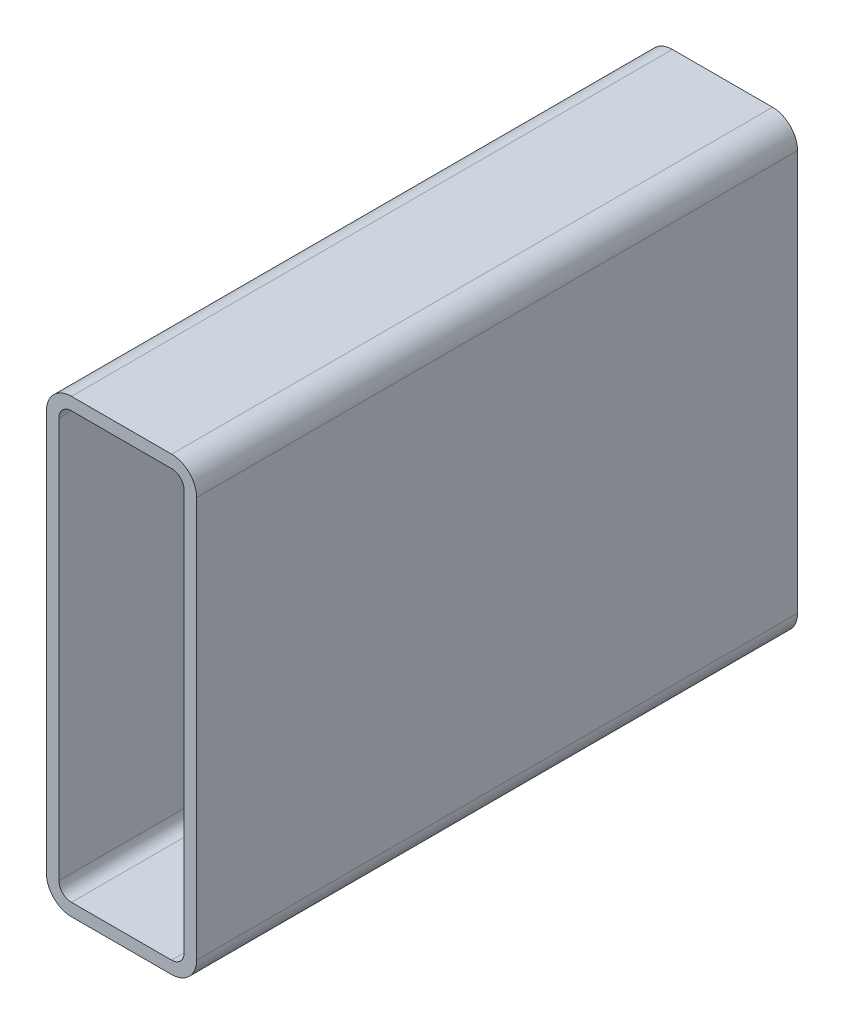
ISO-10303-21;
HEADER;
FILE_DESCRIPTION(('STEP AP214'),'2;1');
FILE_NAME('part.step','',(''),(''),'','','');
FILE_SCHEMA(('AUTOMOTIVE_DESIGN { 1 0 10303 214 1 1 1 1 }'));
ENDSEC;
DATA;
#1=APPLICATION_CONTEXT('core data for automotive mechanical design processes');
#2=APPLICATION_PROTOCOL_DEFINITION('international standard','automotive_design',2000,#1);
#3=PRODUCT_CONTEXT('',#1,'mechanical');
#4=PRODUCT('Part','Part','',(#3));
#5=PRODUCT_RELATED_PRODUCT_CATEGORY('part','',(#4));
#6=PRODUCT_DEFINITION_FORMATION('','',#4);
#7=PRODUCT_DEFINITION_CONTEXT('part definition',#1,'design');
#8=PRODUCT_DEFINITION('design','',#6,#7);
#9=PRODUCT_DEFINITION_SHAPE('','',#8);
#10=(LENGTH_UNIT() NAMED_UNIT(*) SI_UNIT(.MILLI.,.METRE.));
#11=(NAMED_UNIT(*) PLANE_ANGLE_UNIT() SI_UNIT($,.RADIAN.));
#12=(NAMED_UNIT(*) SI_UNIT($,.STERADIAN.) SOLID_ANGLE_UNIT());
#13=UNCERTAINTY_MEASURE_WITH_UNIT(LENGTH_MEASURE(1.E-05),#10,'distance_accuracy_value','');
#14=(GEOMETRIC_REPRESENTATION_CONTEXT(3) GLOBAL_UNCERTAINTY_ASSIGNED_CONTEXT((#13)) GLOBAL_UNIT_ASSIGNED_CONTEXT((#10,
#11,#12)) REPRESENTATION_CONTEXT('',''));
#15=CARTESIAN_POINT('',(0.,0.,0.));
#16=DIRECTION('',(0.,0.,1.));
#17=DIRECTION('',(1.,0.,0.));
#18=AXIS2_PLACEMENT_3D('',#15,#16,#17);
#19=CARTESIAN_POINT('',(15.1891160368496,217.843222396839,304.8));
#20=DIRECTION('',(0.,0.,1.));
#21=DIRECTION('',(1.,0.,0.));
#22=AXIS2_PLACEMENT_3D('',#19,#20,#21);
#23=PLANE('',#22);
#24=CARTESIAN_POINT('',(15.1891160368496,217.843222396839,304.8));
#25=DIRECTION('',(0.,0.,1.));
#26=DIRECTION('',(1.,0.,0.));
#27=AXIS2_PLACEMENT_3D('',#24,#25,#26);
#28=CIRCLE('',#27,12.7);
#29=CARTESIAN_POINT('',(15.1891160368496,230.543222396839,304.8));
#30=VERTEX_POINT('',#29);
#31=CARTESIAN_POINT('',(2.48911603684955,217.843222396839,304.8));
#32=VERTEX_POINT('',#31);
#33=EDGE_CURVE('E211',#30,#32,#28,.T.);
#34=ORIENTED_EDGE('',*,*,#33,.T.);
#35=DIRECTION('',(0.,-1.,0.));
#36=VECTOR('',#35,1.);
#37=CARTESIAN_POINT('',(2.48911603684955,14.6432223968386,304.8));
#38=LINE('',#37,#36);
#39=CARTESIAN_POINT('',(2.48911603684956,14.6432223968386,304.8));
#40=VERTEX_POINT('',#39);
#41=EDGE_CURVE('E214',#32,#40,#38,.T.);
#42=ORIENTED_EDGE('',*,*,#41,.T.);
#43=CARTESIAN_POINT('',(15.1891160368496,14.6432223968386,304.8));
#44=DIRECTION('',(0.,0.,1.));
#45=DIRECTION('',(1.,0.,0.));
#46=AXIS2_PLACEMENT_3D('',#43,#44,#45);
#47=CIRCLE('',#46,12.7);
#48=CARTESIAN_POINT('',(15.1891160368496,1.94322239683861,304.8));
#49=VERTEX_POINT('',#48);
#50=EDGE_CURVE('E217',#40,#49,#47,.T.);
#51=ORIENTED_EDGE('',*,*,#50,.T.);
#52=DIRECTION('',(1.,0.,0.));
#53=VECTOR('',#52,1.);
#54=CARTESIAN_POINT('',(65.9891160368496,1.94322239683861,304.8));
#55=LINE('',#54,#53);
#56=CARTESIAN_POINT('',(65.9891160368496,1.94322239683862,304.8));
#57=VERTEX_POINT('',#56);
#58=EDGE_CURVE('E219',#49,#57,#55,.T.);
#59=ORIENTED_EDGE('',*,*,#58,.T.);
#60=CARTESIAN_POINT('',(65.9891160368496,14.6432223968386,304.8));
#61=DIRECTION('',(0.,0.,1.));
#62=DIRECTION('',(1.,0.,0.));
#63=AXIS2_PLACEMENT_3D('',#60,#61,#62);
#64=CIRCLE('',#63,12.7);
#65=CARTESIAN_POINT('',(78.6891160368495,14.6432223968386,304.8));
#66=VERTEX_POINT('',#65);
#67=EDGE_CURVE('E221',#57,#66,#64,.T.);
#68=ORIENTED_EDGE('',*,*,#67,.T.);
#69=DIRECTION('',(0.,1.,0.));
#70=VECTOR('',#69,1.);
#71=CARTESIAN_POINT('',(78.6891160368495,217.843222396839,304.8));
#72=LINE('',#71,#70);
#73=CARTESIAN_POINT('',(78.6891160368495,217.843222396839,304.8));
#74=VERTEX_POINT('',#73);
#75=EDGE_CURVE('E223',#66,#74,#72,.T.);
#76=ORIENTED_EDGE('',*,*,#75,.T.);
#77=CARTESIAN_POINT('',(65.9891160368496,217.843222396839,304.8));
#78=DIRECTION('',(0.,0.,1.));
#79=DIRECTION('',(1.,0.,0.));
#80=AXIS2_PLACEMENT_3D('',#77,#78,#79);
#81=CIRCLE('',#80,12.7);
#82=CARTESIAN_POINT('',(65.9891160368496,230.543222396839,304.8));
#83=VERTEX_POINT('',#82);
#84=EDGE_CURVE('E225',#74,#83,#81,.T.);
#85=ORIENTED_EDGE('',*,*,#84,.T.);
#86=DIRECTION('',(-1.,0.,0.));
#87=VECTOR('',#86,1.);
#88=CARTESIAN_POINT('',(15.1891160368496,230.543222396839,304.8));
#89=LINE('',#88,#87);
#90=EDGE_CURVE('E227',#83,#30,#89,.T.);
#91=ORIENTED_EDGE('',*,*,#90,.T.);
#92=EDGE_LOOP('',(#34,#42,#51,#59,#68,#76,#85,#91));
#93=FACE_BOUND('',#92,.T.);
#94=DIRECTION('',(0.,-1.,0.));
#95=VECTOR('',#94,1.);
#96=CARTESIAN_POINT('',(8.83911603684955,14.6432223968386,304.8));
#97=LINE('',#96,#95);
#98=CARTESIAN_POINT('',(8.83911603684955,217.843222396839,304.8));
#99=VERTEX_POINT('',#98);
#100=CARTESIAN_POINT('',(8.83911603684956,14.6432223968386,304.8));
#101=VERTEX_POINT('',#100);
#102=EDGE_CURVE('E154',#99,#101,#97,.T.);
#103=ORIENTED_EDGE('',*,*,#102,.F.);
#104=CARTESIAN_POINT('',(15.1891160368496,217.843222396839,304.8));
#105=DIRECTION('',(0.,0.,1.));
#106=DIRECTION('',(1.,0.,0.));
#107=AXIS2_PLACEMENT_3D('',#104,#105,#106);
#108=CIRCLE('',#107,6.35);
#109=CARTESIAN_POINT('',(15.1891160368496,224.193222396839,304.8));
#110=VERTEX_POINT('',#109);
#111=EDGE_CURVE('E146',#110,#99,#108,.T.);
#112=ORIENTED_EDGE('',*,*,#111,.F.);
#113=DIRECTION('',(-1.,0.,0.));
#114=VECTOR('',#113,1.);
#115=CARTESIAN_POINT('',(15.1891160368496,224.193222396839,304.8));
#116=LINE('',#115,#114);
#117=CARTESIAN_POINT('',(65.9891160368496,224.193222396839,304.8));
#118=VERTEX_POINT('',#117);
#119=EDGE_CURVE('E179',#118,#110,#116,.T.);
#120=ORIENTED_EDGE('',*,*,#119,.F.);
#121=CARTESIAN_POINT('',(65.9891160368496,217.843222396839,304.8));
#122=DIRECTION('',(0.,0.,1.));
#123=DIRECTION('',(1.,0.,0.));
#124=AXIS2_PLACEMENT_3D('',#121,#122,#123);
#125=CIRCLE('',#124,6.34999999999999);
#126=CARTESIAN_POINT('',(72.3391160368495,217.843222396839,304.8));
#127=VERTEX_POINT('',#126);
#128=EDGE_CURVE('E177',#127,#118,#125,.T.);
#129=ORIENTED_EDGE('',*,*,#128,.F.);
#130=DIRECTION('',(0.,1.,0.));
#131=VECTOR('',#130,1.);
#132=CARTESIAN_POINT('',(72.3391160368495,217.843222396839,304.8));
#133=LINE('',#132,#131);
#134=CARTESIAN_POINT('',(72.3391160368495,14.6432223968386,304.8));
#135=VERTEX_POINT('',#134);
#136=EDGE_CURVE('E175',#135,#127,#133,.T.);
#137=ORIENTED_EDGE('',*,*,#136,.F.);
#138=CARTESIAN_POINT('',(65.9891160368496,14.6432223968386,304.8));
#139=DIRECTION('',(0.,0.,1.));
#140=DIRECTION('',(1.,0.,0.));
#141=AXIS2_PLACEMENT_3D('',#138,#139,#140);
#142=CIRCLE('',#141,6.35);
#143=CARTESIAN_POINT('',(65.9891160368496,8.29322239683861,304.8));
#144=VERTEX_POINT('',#143);
#145=EDGE_CURVE('E173',#144,#135,#142,.T.);
#146=ORIENTED_EDGE('',*,*,#145,.F.);
#147=DIRECTION('',(1.,0.,0.));
#148=VECTOR('',#147,1.);
#149=CARTESIAN_POINT('',(65.9891160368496,8.29322239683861,304.8));
#150=LINE('',#149,#148);
#151=CARTESIAN_POINT('',(15.1891160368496,8.29322239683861,304.8));
#152=VERTEX_POINT('',#151);
#153=EDGE_CURVE('E169',#152,#144,#150,.T.);
#154=ORIENTED_EDGE('',*,*,#153,.F.);
#155=CARTESIAN_POINT('',(15.1891160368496,14.6432223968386,304.8));
#156=DIRECTION('',(0.,0.,1.));
#157=DIRECTION('',(1.,0.,0.));
#158=AXIS2_PLACEMENT_3D('',#155,#156,#157);
#159=CIRCLE('',#158,6.35);
#160=EDGE_CURVE('E167',#101,#152,#159,.T.);
#161=ORIENTED_EDGE('',*,*,#160,.F.);
#162=EDGE_LOOP('',(#103,#112,#120,#129,#137,#146,#154,#161));
#163=FACE_BOUND('',#162,.T.);
#164=ADVANCED_FACE('F33',(#93,#163),#23,.T.);
#165=CARTESIAN_POINT('',(15.1891160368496,217.843222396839,0.));
#166=DIRECTION('',(0.,0.,1.));
#167=DIRECTION('',(1.,0.,0.));
#168=AXIS2_PLACEMENT_3D('',#165,#166,#167);
#169=PLANE('',#168);
#170=CARTESIAN_POINT('',(15.1891160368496,217.843222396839,0.));
#171=DIRECTION('',(0.,0.,1.));
#172=DIRECTION('',(1.,0.,0.));
#173=AXIS2_PLACEMENT_3D('',#170,#171,#172);
#174=CIRCLE('',#173,12.7);
#175=CARTESIAN_POINT('',(15.1891160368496,230.543222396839,0.));
#176=VERTEX_POINT('',#175);
#177=CARTESIAN_POINT('',(2.48911603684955,217.843222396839,0.));
#178=VERTEX_POINT('',#177);
#179=EDGE_CURVE('E162',#176,#178,#174,.T.);
#180=ORIENTED_EDGE('',*,*,#179,.F.);
#181=DIRECTION('',(-1.,0.,0.));
#182=VECTOR('',#181,1.);
#183=CARTESIAN_POINT('',(15.1891160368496,230.543222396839,0.));
#184=LINE('',#183,#182);
#185=CARTESIAN_POINT('',(65.9891160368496,230.543222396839,0.));
#186=VERTEX_POINT('',#185);
#187=EDGE_CURVE('E215',#186,#176,#184,.T.);
#188=ORIENTED_EDGE('',*,*,#187,.F.);
#189=CARTESIAN_POINT('',(65.9891160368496,217.843222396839,0.));
#190=DIRECTION('',(0.,0.,1.));
#191=DIRECTION('',(1.,0.,0.));
#192=AXIS2_PLACEMENT_3D('',#189,#190,#191);
#193=CIRCLE('',#192,12.7);
#194=CARTESIAN_POINT('',(78.6891160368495,217.843222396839,0.));
#195=VERTEX_POINT('',#194);
#196=EDGE_CURVE('E242',#195,#186,#193,.T.);
#197=ORIENTED_EDGE('',*,*,#196,.F.);
#198=DIRECTION('',(0.,1.,0.));
#199=VECTOR('',#198,1.);
#200=CARTESIAN_POINT('',(78.6891160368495,217.843222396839,0.));
#201=LINE('',#200,#199);
#202=CARTESIAN_POINT('',(78.6891160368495,14.6432223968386,0.));
#203=VERTEX_POINT('',#202);
#204=EDGE_CURVE('E240',#203,#195,#201,.T.);
#205=ORIENTED_EDGE('',*,*,#204,.F.);
#206=CARTESIAN_POINT('',(65.9891160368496,14.6432223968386,0.));
#207=DIRECTION('',(0.,0.,1.));
#208=DIRECTION('',(1.,0.,0.));
#209=AXIS2_PLACEMENT_3D('',#206,#207,#208);
#210=CIRCLE('',#209,12.7);
#211=CARTESIAN_POINT('',(65.9891160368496,1.94322239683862,0.));
#212=VERTEX_POINT('',#211);
#213=EDGE_CURVE('E238',#212,#203,#210,.T.);
#214=ORIENTED_EDGE('',*,*,#213,.F.);
#215=DIRECTION('',(1.,0.,0.));
#216=VECTOR('',#215,1.);
#217=CARTESIAN_POINT('',(65.9891160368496,1.94322239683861,0.));
#218=LINE('',#217,#216);
#219=CARTESIAN_POINT('',(15.1891160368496,1.94322239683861,0.));
#220=VERTEX_POINT('',#219);
#221=EDGE_CURVE('E236',#220,#212,#218,.T.);
#222=ORIENTED_EDGE('',*,*,#221,.F.);
#223=CARTESIAN_POINT('',(15.1891160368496,14.6432223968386,0.));
#224=DIRECTION('',(0.,0.,1.));
#225=DIRECTION('',(1.,0.,0.));
#226=AXIS2_PLACEMENT_3D('',#223,#224,#225);
#227=CIRCLE('',#226,12.7);
#228=CARTESIAN_POINT('',(2.48911603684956,14.6432223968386,0.));
#229=VERTEX_POINT('',#228);
#230=EDGE_CURVE('E234',#229,#220,#227,.T.);
#231=ORIENTED_EDGE('',*,*,#230,.F.);
#232=DIRECTION('',(0.,-1.,0.));
#233=VECTOR('',#232,1.);
#234=CARTESIAN_POINT('',(2.48911603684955,14.6432223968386,0.));
#235=LINE('',#234,#233);
#236=EDGE_CURVE('E232',#178,#229,#235,.T.);
#237=ORIENTED_EDGE('',*,*,#236,.F.);
#238=EDGE_LOOP('',(#180,#188,#197,#205,#214,#222,#231,#237));
#239=FACE_BOUND('',#238,.T.);
#240=CARTESIAN_POINT('',(15.1891160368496,217.843222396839,0.));
#241=DIRECTION('',(0.,0.,1.));
#242=DIRECTION('',(1.,0.,0.));
#243=AXIS2_PLACEMENT_3D('',#240,#241,#242);
#244=CIRCLE('',#243,6.35);
#245=CARTESIAN_POINT('',(15.1891160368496,224.193222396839,0.));
#246=VERTEX_POINT('',#245);
#247=CARTESIAN_POINT('',(8.83911603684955,217.843222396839,0.));
#248=VERTEX_POINT('',#247);
#249=EDGE_CURVE('E56',#246,#248,#244,.T.);
#250=ORIENTED_EDGE('',*,*,#249,.T.);
#251=DIRECTION('',(0.,-1.,0.));
#252=VECTOR('',#251,1.);
#253=CARTESIAN_POINT('',(8.83911603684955,14.6432223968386,0.));
#254=LINE('',#253,#252);
#255=CARTESIAN_POINT('',(8.83911603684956,14.6432223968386,0.));
#256=VERTEX_POINT('',#255);
#257=EDGE_CURVE('E161',#248,#256,#254,.T.);
#258=ORIENTED_EDGE('',*,*,#257,.T.);
#259=CARTESIAN_POINT('',(15.1891160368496,14.6432223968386,0.));
#260=DIRECTION('',(0.,0.,1.));
#261=DIRECTION('',(1.,0.,0.));
#262=AXIS2_PLACEMENT_3D('',#259,#260,#261);
#263=CIRCLE('',#262,6.35);
#264=CARTESIAN_POINT('',(15.1891160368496,8.29322239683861,0.));
#265=VERTEX_POINT('',#264);
#266=EDGE_CURVE('E183',#256,#265,#263,.T.);
#267=ORIENTED_EDGE('',*,*,#266,.T.);
#268=DIRECTION('',(1.,0.,0.));
#269=VECTOR('',#268,1.);
#270=CARTESIAN_POINT('',(65.9891160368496,8.29322239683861,0.));
#271=LINE('',#270,#269);
#272=CARTESIAN_POINT('',(65.9891160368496,8.29322239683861,0.));
#273=VERTEX_POINT('',#272);
#274=EDGE_CURVE('E186',#265,#273,#271,.T.);
#275=ORIENTED_EDGE('',*,*,#274,.T.);
#276=CARTESIAN_POINT('',(65.9891160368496,14.6432223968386,0.));
#277=DIRECTION('',(0.,0.,1.));
#278=DIRECTION('',(1.,0.,0.));
#279=AXIS2_PLACEMENT_3D('',#276,#277,#278);
#280=CIRCLE('',#279,6.35);
#281=CARTESIAN_POINT('',(72.3391160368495,14.6432223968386,0.));
#282=VERTEX_POINT('',#281);
#283=EDGE_CURVE('E189',#273,#282,#280,.T.);
#284=ORIENTED_EDGE('',*,*,#283,.T.);
#285=DIRECTION('',(0.,1.,0.));
#286=VECTOR('',#285,1.);
#287=CARTESIAN_POINT('',(72.3391160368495,217.843222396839,0.));
#288=LINE('',#287,#286);
#289=CARTESIAN_POINT('',(72.3391160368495,217.843222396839,0.));
#290=VERTEX_POINT('',#289);
#291=EDGE_CURVE('E192',#282,#290,#288,.T.);
#292=ORIENTED_EDGE('',*,*,#291,.T.);
#293=CARTESIAN_POINT('',(65.9891160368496,217.843222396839,0.));
#294=DIRECTION('',(0.,0.,1.));
#295=DIRECTION('',(1.,0.,0.));
#296=AXIS2_PLACEMENT_3D('',#293,#294,#295);
#297=CIRCLE('',#296,6.34999999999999);
#298=CARTESIAN_POINT('',(65.9891160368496,224.193222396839,0.));
#299=VERTEX_POINT('',#298);
#300=EDGE_CURVE('E195',#290,#299,#297,.T.);
#301=ORIENTED_EDGE('',*,*,#300,.T.);
#302=DIRECTION('',(-1.,0.,0.));
#303=VECTOR('',#302,1.);
#304=CARTESIAN_POINT('',(15.1891160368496,224.193222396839,0.));
#305=LINE('',#304,#303);
#306=EDGE_CURVE('E155',#299,#246,#305,.T.);
#307=ORIENTED_EDGE('',*,*,#306,.T.);
#308=EDGE_LOOP('',(#250,#258,#267,#275,#284,#292,#301,#307));
#309=FACE_BOUND('',#308,.T.);
#310=ADVANCED_FACE('F272',(#239,#309),#169,.F.);
#311=CARTESIAN_POINT('',(15.1891160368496,217.843222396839,304.8));
#312=DIRECTION('',(0.,0.,-1.));
#313=DIRECTION('',(-1.,0.,0.));
#314=AXIS2_PLACEMENT_3D('',#311,#312,#313);
#315=CYLINDRICAL_SURFACE('',#314,12.7);
#316=ORIENTED_EDGE('',*,*,#179,.T.);
#317=DIRECTION('',(0.,0.,-1.));
#318=VECTOR('',#317,1.);
#319=CARTESIAN_POINT('',(2.48911603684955,217.843222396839,304.8));
#320=LINE('',#319,#318);
#321=EDGE_CURVE('E11',#32,#178,#320,.T.);
#322=ORIENTED_EDGE('',*,*,#321,.F.);
#323=ORIENTED_EDGE('',*,*,#33,.F.);
#324=DIRECTION('',(0.,0.,-1.));
#325=VECTOR('',#324,1.);
#326=CARTESIAN_POINT('',(15.1891160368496,230.543222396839,304.8));
#327=LINE('',#326,#325);
#328=EDGE_CURVE('E229',#30,#176,#327,.T.);
#329=ORIENTED_EDGE('',*,*,#328,.T.);
#330=EDGE_LOOP('',(#316,#322,#323,#329));
#331=FACE_BOUND('',#330,.T.);
#332=ADVANCED_FACE('F35',(#331),#315,.T.);
#333=CARTESIAN_POINT('',(2.48911603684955,14.6432223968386,304.8));
#334=DIRECTION('',(1.,0.,0.));
#335=DIRECTION('',(0.,0.,-1.));
#336=AXIS2_PLACEMENT_3D('',#333,#334,#335);
#337=PLANE('',#336);
#338=ORIENTED_EDGE('',*,*,#236,.T.);
#339=DIRECTION('',(0.,0.,-1.));
#340=VECTOR('',#339,1.);
#341=CARTESIAN_POINT('',(2.48911603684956,14.6432223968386,304.8));
#342=LINE('',#341,#340);
#343=EDGE_CURVE('E41',#40,#229,#342,.T.);
#344=ORIENTED_EDGE('',*,*,#343,.F.);
#345=ORIENTED_EDGE('',*,*,#41,.F.);
#346=ORIENTED_EDGE('',*,*,#321,.T.);
#347=EDGE_LOOP('',(#338,#344,#345,#346));
#348=FACE_BOUND('',#347,.T.);
#349=ADVANCED_FACE('F289',(#348),#337,.F.);
#350=CARTESIAN_POINT('',(15.1891160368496,14.6432223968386,304.8));
#351=DIRECTION('',(0.,0.,-1.));
#352=DIRECTION('',(-1.,0.,0.));
#353=AXIS2_PLACEMENT_3D('',#350,#351,#352);
#354=CYLINDRICAL_SURFACE('',#353,12.7);
#355=ORIENTED_EDGE('',*,*,#230,.T.);
#356=DIRECTION('',(0.,0.,-1.));
#357=VECTOR('',#356,1.);
#358=CARTESIAN_POINT('',(15.1891160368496,1.94322239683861,304.8));
#359=LINE('',#358,#357);
#360=EDGE_CURVE('E259',#49,#220,#359,.T.);
#361=ORIENTED_EDGE('',*,*,#360,.F.);
#362=ORIENTED_EDGE('',*,*,#50,.F.);
#363=ORIENTED_EDGE('',*,*,#343,.T.);
#364=EDGE_LOOP('',(#355,#361,#362,#363));
#365=FACE_BOUND('',#364,.T.);
#366=ADVANCED_FACE('F266',(#365),#354,.T.);
#367=CARTESIAN_POINT('',(65.9891160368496,1.94322239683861,304.8));
#368=DIRECTION('',(0.,1.,0.));
#369=DIRECTION('',(0.,0.,1.));
#370=AXIS2_PLACEMENT_3D('',#367,#368,#369);
#371=PLANE('',#370);
#372=ORIENTED_EDGE('',*,*,#221,.T.);
#373=DIRECTION('',(0.,0.,-1.));
#374=VECTOR('',#373,1.);
#375=CARTESIAN_POINT('',(65.9891160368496,1.94322239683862,304.8));
#376=LINE('',#375,#374);
#377=EDGE_CURVE('E256',#57,#212,#376,.T.);
#378=ORIENTED_EDGE('',*,*,#377,.F.);
#379=ORIENTED_EDGE('',*,*,#58,.F.);
#380=ORIENTED_EDGE('',*,*,#360,.T.);
#381=EDGE_LOOP('',(#372,#378,#379,#380));
#382=FACE_BOUND('',#381,.T.);
#383=ADVANCED_FACE('F278',(#382),#371,.F.);
#384=CARTESIAN_POINT('',(65.9891160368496,14.6432223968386,304.8));
#385=DIRECTION('',(0.,0.,-1.));
#386=DIRECTION('',(-1.,0.,0.));
#387=AXIS2_PLACEMENT_3D('',#384,#385,#386);
#388=CYLINDRICAL_SURFACE('',#387,12.7);
#389=ORIENTED_EDGE('',*,*,#213,.T.);
#390=DIRECTION('',(0.,0.,-1.));
#391=VECTOR('',#390,1.);
#392=CARTESIAN_POINT('',(78.6891160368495,14.6432223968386,304.8));
#393=LINE('',#392,#391);
#394=EDGE_CURVE('E253',#66,#203,#393,.T.);
#395=ORIENTED_EDGE('',*,*,#394,.F.);
#396=ORIENTED_EDGE('',*,*,#67,.F.);
#397=ORIENTED_EDGE('',*,*,#377,.T.);
#398=EDGE_LOOP('',(#389,#395,#396,#397));
#399=FACE_BOUND('',#398,.T.);
#400=ADVANCED_FACE('F282',(#399),#388,.T.);
#401=CARTESIAN_POINT('',(78.6891160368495,217.843222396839,304.8));
#402=DIRECTION('',(-1.,0.,0.));
#403=DIRECTION('',(0.,0.,1.));
#404=AXIS2_PLACEMENT_3D('',#401,#402,#403);
#405=PLANE('',#404);
#406=ORIENTED_EDGE('',*,*,#204,.T.);
#407=DIRECTION('',(0.,0.,-1.));
#408=VECTOR('',#407,1.);
#409=CARTESIAN_POINT('',(78.6891160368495,217.843222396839,304.8));
#410=LINE('',#409,#408);
#411=EDGE_CURVE('E250',#74,#195,#410,.T.);
#412=ORIENTED_EDGE('',*,*,#411,.F.);
#413=ORIENTED_EDGE('',*,*,#75,.F.);
#414=ORIENTED_EDGE('',*,*,#394,.T.);
#415=EDGE_LOOP('',(#406,#412,#413,#414));
#416=FACE_BOUND('',#415,.T.);
#417=ADVANCED_FACE('F302',(#416),#405,.F.);
#418=CARTESIAN_POINT('',(65.9891160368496,217.843222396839,304.8));
#419=DIRECTION('',(0.,0.,-1.));
#420=DIRECTION('',(-1.,0.,0.));
#421=AXIS2_PLACEMENT_3D('',#418,#419,#420);
#422=CYLINDRICAL_SURFACE('',#421,12.7);
#423=ORIENTED_EDGE('',*,*,#196,.T.);
#424=DIRECTION('',(0.,0.,-1.));
#425=VECTOR('',#424,1.);
#426=CARTESIAN_POINT('',(65.9891160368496,230.543222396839,304.8));
#427=LINE('',#426,#425);
#428=EDGE_CURVE('E247',#83,#186,#427,.T.);
#429=ORIENTED_EDGE('',*,*,#428,.F.);
#430=ORIENTED_EDGE('',*,*,#84,.F.);
#431=ORIENTED_EDGE('',*,*,#411,.T.);
#432=EDGE_LOOP('',(#423,#429,#430,#431));
#433=FACE_BOUND('',#432,.T.);
#434=ADVANCED_FACE('F300',(#433),#422,.T.);
#435=CARTESIAN_POINT('',(15.1891160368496,230.543222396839,304.8));
#436=DIRECTION('',(0.,-1.,0.));
#437=DIRECTION('',(0.,0.,-1.));
#438=AXIS2_PLACEMENT_3D('',#435,#436,#437);
#439=PLANE('',#438);
#440=ORIENTED_EDGE('',*,*,#187,.T.);
#441=ORIENTED_EDGE('',*,*,#328,.F.);
#442=ORIENTED_EDGE('',*,*,#90,.F.);
#443=ORIENTED_EDGE('',*,*,#428,.T.);
#444=EDGE_LOOP('',(#440,#441,#442,#443));
#445=FACE_BOUND('',#444,.T.);
#446=ADVANCED_FACE('F295',(#445),#439,.F.);
#447=CARTESIAN_POINT('',(15.1891160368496,217.843222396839,304.8));
#448=DIRECTION('',(0.,0.,-1.));
#449=DIRECTION('',(-1.,0.,0.));
#450=AXIS2_PLACEMENT_3D('',#447,#448,#449);
#451=CYLINDRICAL_SURFACE('',#450,6.35);
#452=ORIENTED_EDGE('',*,*,#249,.F.);
#453=DIRECTION('',(0.,0.,-1.));
#454=VECTOR('',#453,1.);
#455=CARTESIAN_POINT('',(15.1891160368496,224.193222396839,304.8));
#456=LINE('',#455,#454);
#457=EDGE_CURVE('E150',#110,#246,#456,.T.);
#458=ORIENTED_EDGE('',*,*,#457,.F.);
#459=ORIENTED_EDGE('',*,*,#111,.T.);
#460=DIRECTION('',(0.,0.,-1.));
#461=VECTOR('',#460,1.);
#462=CARTESIAN_POINT('',(8.83911603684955,217.843222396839,304.8));
#463=LINE('',#462,#461);
#464=EDGE_CURVE('E149',#99,#248,#463,.T.);
#465=ORIENTED_EDGE('',*,*,#464,.T.);
#466=EDGE_LOOP('',(#452,#458,#459,#465));
#467=FACE_BOUND('',#466,.T.);
#468=ADVANCED_FACE('F148',(#467),#451,.F.);
#469=CARTESIAN_POINT('',(8.83911603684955,14.6432223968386,304.8));
#470=DIRECTION('',(1.,0.,0.));
#471=DIRECTION('',(0.,0.,-1.));
#472=AXIS2_PLACEMENT_3D('',#469,#470,#471);
#473=PLANE('',#472);
#474=ORIENTED_EDGE('',*,*,#257,.F.);
#475=ORIENTED_EDGE('',*,*,#464,.F.);
#476=ORIENTED_EDGE('',*,*,#102,.T.);
#477=DIRECTION('',(0.,0.,-1.));
#478=VECTOR('',#477,1.);
#479=CARTESIAN_POINT('',(8.83911603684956,14.6432223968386,304.8));
#480=LINE('',#479,#478);
#481=EDGE_CURVE('E163',#101,#256,#480,.T.);
#482=ORIENTED_EDGE('',*,*,#481,.T.);
#483=EDGE_LOOP('',(#474,#475,#476,#482));
#484=FACE_BOUND('',#483,.T.);
#485=ADVANCED_FACE('F158',(#484),#473,.T.);
#486=CARTESIAN_POINT('',(15.1891160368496,14.6432223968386,304.8));
#487=DIRECTION('',(0.,0.,-1.));
#488=DIRECTION('',(-1.,0.,0.));
#489=AXIS2_PLACEMENT_3D('',#486,#487,#488);
#490=CYLINDRICAL_SURFACE('',#489,6.35);
#491=ORIENTED_EDGE('',*,*,#266,.F.);
#492=ORIENTED_EDGE('',*,*,#481,.F.);
#493=ORIENTED_EDGE('',*,*,#160,.T.);
#494=DIRECTION('',(0.,0.,-1.));
#495=VECTOR('',#494,1.);
#496=CARTESIAN_POINT('',(15.1891160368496,8.29322239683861,304.8));
#497=LINE('',#496,#495);
#498=EDGE_CURVE('E208',#152,#265,#497,.T.);
#499=ORIENTED_EDGE('',*,*,#498,.T.);
#500=EDGE_LOOP('',(#491,#492,#493,#499));
#501=FACE_BOUND('',#500,.T.);
#502=ADVANCED_FACE('F327',(#501),#490,.F.);
#503=CARTESIAN_POINT('',(65.9891160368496,8.29322239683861,304.8));
#504=DIRECTION('',(0.,1.,0.));
#505=DIRECTION('',(0.,0.,1.));
#506=AXIS2_PLACEMENT_3D('',#503,#504,#505);
#507=PLANE('',#506);
#508=ORIENTED_EDGE('',*,*,#274,.F.);
#509=ORIENTED_EDGE('',*,*,#498,.F.);
#510=ORIENTED_EDGE('',*,*,#153,.T.);
#511=DIRECTION('',(0.,0.,-1.));
#512=VECTOR('',#511,1.);
#513=CARTESIAN_POINT('',(65.9891160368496,8.29322239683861,304.8));
#514=LINE('',#513,#512);
#515=EDGE_CURVE('E206',#144,#273,#514,.T.);
#516=ORIENTED_EDGE('',*,*,#515,.T.);
#517=EDGE_LOOP('',(#508,#509,#510,#516));
#518=FACE_BOUND('',#517,.T.);
#519=ADVANCED_FACE('F331',(#518),#507,.T.);
#520=CARTESIAN_POINT('',(65.9891160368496,14.6432223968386,304.8));
#521=DIRECTION('',(0.,0.,-1.));
#522=DIRECTION('',(-1.,0.,0.));
#523=AXIS2_PLACEMENT_3D('',#520,#521,#522);
#524=CYLINDRICAL_SURFACE('',#523,6.35);
#525=ORIENTED_EDGE('',*,*,#283,.F.);
#526=ORIENTED_EDGE('',*,*,#515,.F.);
#527=ORIENTED_EDGE('',*,*,#145,.T.);
#528=DIRECTION('',(0.,0.,-1.));
#529=VECTOR('',#528,1.);
#530=CARTESIAN_POINT('',(72.3391160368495,14.6432223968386,304.8));
#531=LINE('',#530,#529);
#532=EDGE_CURVE('E204',#135,#282,#531,.T.);
#533=ORIENTED_EDGE('',*,*,#532,.T.);
#534=EDGE_LOOP('',(#525,#526,#527,#533));
#535=FACE_BOUND('',#534,.T.);
#536=ADVANCED_FACE('F337',(#535),#524,.F.);
#537=CARTESIAN_POINT('',(72.3391160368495,217.843222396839,304.8));
#538=DIRECTION('',(-1.,0.,0.));
#539=DIRECTION('',(0.,0.,1.));
#540=AXIS2_PLACEMENT_3D('',#537,#538,#539);
#541=PLANE('',#540);
#542=ORIENTED_EDGE('',*,*,#291,.F.);
#543=ORIENTED_EDGE('',*,*,#532,.F.);
#544=ORIENTED_EDGE('',*,*,#136,.T.);
#545=DIRECTION('',(0.,0.,-1.));
#546=VECTOR('',#545,1.);
#547=CARTESIAN_POINT('',(72.3391160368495,217.843222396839,304.8));
#548=LINE('',#547,#546);
#549=EDGE_CURVE('E202',#127,#290,#548,.T.);
#550=ORIENTED_EDGE('',*,*,#549,.T.);
#551=EDGE_LOOP('',(#542,#543,#544,#550));
#552=FACE_BOUND('',#551,.T.);
#553=ADVANCED_FACE('F341',(#552),#541,.T.);
#554=CARTESIAN_POINT('',(65.9891160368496,217.843222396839,304.8));
#555=DIRECTION('',(0.,0.,-1.));
#556=DIRECTION('',(-1.,0.,0.));
#557=AXIS2_PLACEMENT_3D('',#554,#555,#556);
#558=CYLINDRICAL_SURFACE('',#557,6.34999999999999);
#559=ORIENTED_EDGE('',*,*,#300,.F.);
#560=ORIENTED_EDGE('',*,*,#549,.F.);
#561=ORIENTED_EDGE('',*,*,#128,.T.);
#562=DIRECTION('',(0.,0.,-1.));
#563=VECTOR('',#562,1.);
#564=CARTESIAN_POINT('',(65.9891160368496,224.193222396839,304.8));
#565=LINE('',#564,#563);
#566=EDGE_CURVE('E48',#118,#299,#565,.T.);
#567=ORIENTED_EDGE('',*,*,#566,.T.);
#568=EDGE_LOOP('',(#559,#560,#561,#567));
#569=FACE_BOUND('',#568,.T.);
#570=ADVANCED_FACE('F345',(#569),#558,.F.);
#571=CARTESIAN_POINT('',(15.1891160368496,224.193222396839,304.8));
#572=DIRECTION('',(0.,-1.,0.));
#573=DIRECTION('',(0.,0.,-1.));
#574=AXIS2_PLACEMENT_3D('',#571,#572,#573);
#575=PLANE('',#574);
#576=ORIENTED_EDGE('',*,*,#306,.F.);
#577=ORIENTED_EDGE('',*,*,#566,.F.);
#578=ORIENTED_EDGE('',*,*,#119,.T.);
#579=ORIENTED_EDGE('',*,*,#457,.T.);
#580=EDGE_LOOP('',(#576,#577,#578,#579));
#581=FACE_BOUND('',#580,.T.);
#582=ADVANCED_FACE('F349',(#581),#575,.T.);
#583=CLOSED_SHELL('',(#164,#310,#332,#349,#366,#383,#400,#417,#434,#446,#468,#485,#502,#519,
#536,#553,#570,#582));
#584=MANIFOLD_SOLID_BREP('B2',#583);
#585=ADVANCED_BREP_SHAPE_REPRESENTATION('',(#18,#584),#14);
#586=SHAPE_DEFINITION_REPRESENTATION(#9,#585);
ENDSEC;
END-ISO-10303-21;
